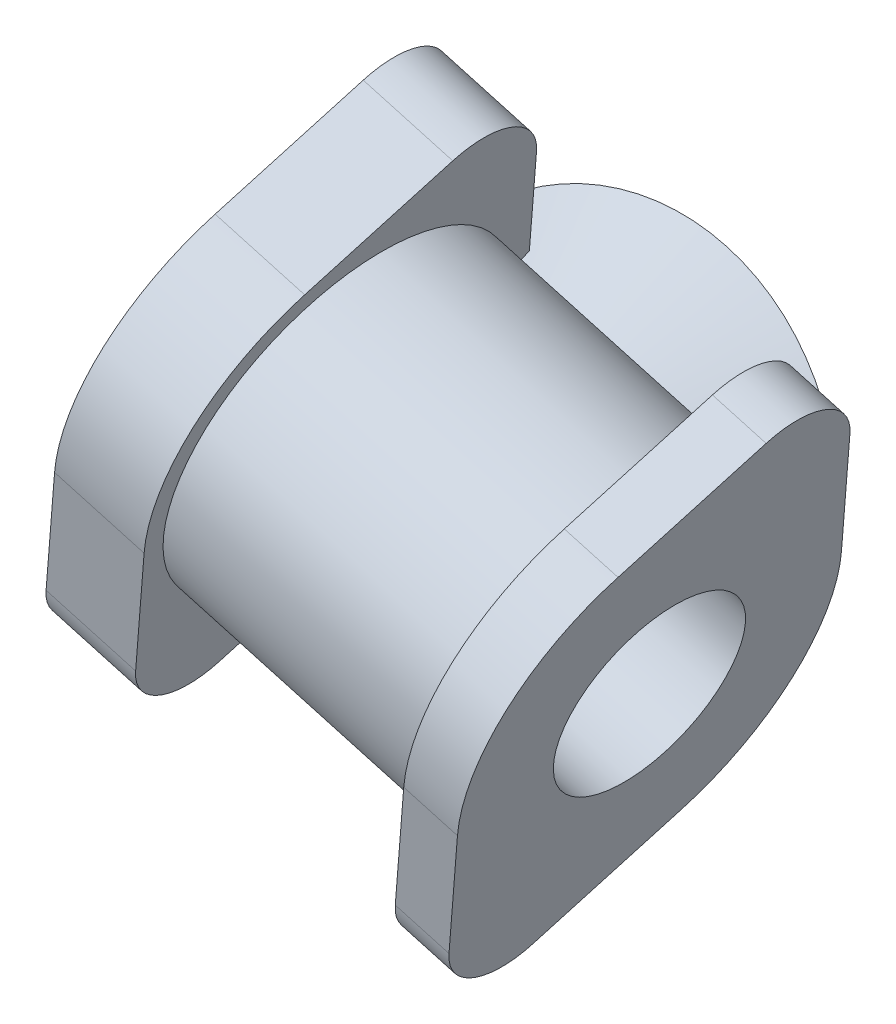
ISO-10303-21;
HEADER;
FILE_DESCRIPTION(('STEP AP214'),'2;1');
FILE_NAME('part.step','',(''),(''),'','','');
FILE_SCHEMA(('AUTOMOTIVE_DESIGN { 1 0 10303 214 1 1 1 1 }'));
ENDSEC;
DATA;
#1=APPLICATION_CONTEXT('core data for automotive mechanical design processes');
#2=APPLICATION_PROTOCOL_DEFINITION('international standard','automotive_design',2000,#1);
#3=PRODUCT_CONTEXT('',#1,'mechanical');
#4=PRODUCT('Part','Part','',(#3));
#5=PRODUCT_RELATED_PRODUCT_CATEGORY('part','',(#4));
#6=PRODUCT_DEFINITION_FORMATION('','',#4);
#7=PRODUCT_DEFINITION_CONTEXT('part definition',#1,'design');
#8=PRODUCT_DEFINITION('design','',#6,#7);
#9=PRODUCT_DEFINITION_SHAPE('','',#8);
#10=(LENGTH_UNIT() NAMED_UNIT(*) SI_UNIT(.MILLI.,.METRE.));
#11=(NAMED_UNIT(*) PLANE_ANGLE_UNIT() SI_UNIT($,.RADIAN.));
#12=(NAMED_UNIT(*) SI_UNIT($,.STERADIAN.) SOLID_ANGLE_UNIT());
#13=UNCERTAINTY_MEASURE_WITH_UNIT(LENGTH_MEASURE(1.E-05),#10,'distance_accuracy_value','');
#14=(GEOMETRIC_REPRESENTATION_CONTEXT(3) GLOBAL_UNCERTAINTY_ASSIGNED_CONTEXT((#13)) GLOBAL_UNIT_ASSIGNED_CONTEXT((#10,
#11,#12)) REPRESENTATION_CONTEXT('',''));
#15=CARTESIAN_POINT('',(0.,0.,0.));
#16=DIRECTION('',(0.,0.,1.));
#17=DIRECTION('',(1.,0.,0.));
#18=AXIS2_PLACEMENT_3D('',#15,#16,#17);
#19=CARTESIAN_POINT('',(-884.568440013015,-292.24881423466,-445.430034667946));
#20=DIRECTION('',(0.962250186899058,-0.272162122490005,-0.00153521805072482));
#21=DIRECTION('',(0.272162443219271,0.962251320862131,0.));
#22=AXIS2_PLACEMENT_3D('',#19,#20,#21);
#23=CYLINDRICAL_SURFACE('',#22,12.7);
#24=CARTESIAN_POINT('',(-884.568440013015,-292.24881423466,-445.430034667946));
#25=DIRECTION('',(0.962250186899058,-0.272162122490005,-0.00153521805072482));
#26=DIRECTION('',(0.272162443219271,0.962251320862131,0.));
#27=AXIS2_PLACEMENT_3D('',#24,#25,#26);
#28=CIRCLE('',#27,12.7);
#29=CARTESIAN_POINT('',(-881.11197698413,-280.028222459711,-445.430034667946));
#30=VERTEX_POINT('',#29);
#31=EDGE_CURVE('E211',#30,#30,#28,.F.);
#32=ORIENTED_EDGE('',*,*,#31,.T.);
#33=EDGE_LOOP('',(#32));
#34=FACE_BOUND('',#33,.T.);
#35=CARTESIAN_POINT('',(-829.575841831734,-307.802879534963,-445.517772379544));
#36=DIRECTION('',(0.962250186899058,-0.272162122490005,-0.00153521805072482));
#37=DIRECTION('',(0.272162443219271,0.962251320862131,0.));
#38=AXIS2_PLACEMENT_3D('',#35,#36,#37);
#39=CIRCLE('',#38,12.7);
#40=CARTESIAN_POINT('',(-826.119378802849,-295.582287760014,-445.517772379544));
#41=VERTEX_POINT('',#40);
#42=EDGE_CURVE('E20',#41,#41,#39,.T.);
#43=ORIENTED_EDGE('',*,*,#42,.T.);
#44=EDGE_LOOP('',(#43));
#45=FACE_BOUND('',#44,.T.);
#46=ADVANCED_FACE('F17',(#34,#45),#23,.F.);
#47=CARTESIAN_POINT('',(-836.908188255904,-305.72900416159,-445.506074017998));
#48=DIRECTION('',(0.962250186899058,-0.272162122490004,-0.00153521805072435));
#49=DIRECTION('',(0.272162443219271,0.962251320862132,0.));
#50=AXIS2_PLACEMENT_3D('',#47,#48,#49);
#51=PLANE('',#50);
#52=CARTESIAN_POINT('',(-836.908188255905,-305.72900416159,-445.506074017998));
#53=DIRECTION('',(0.962250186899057,-0.272162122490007,-0.00153521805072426));
#54=DIRECTION('',(0.272162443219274,0.962251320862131,0.));
#55=AXIS2_PLACEMENT_3D('',#52,#53,#54);
#56=CIRCLE('',#55,25.4);
#57=CARTESIAN_POINT('',(-840.825380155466,-319.460044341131,-466.5126002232));
#58=VERTEX_POINT('',#57);
#59=CARTESIAN_POINT('',(-837.885848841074,-309.043654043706,-470.669882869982));
#60=VERTEX_POINT('',#59);
#61=EDGE_CURVE('E370',#58,#60,#56,.T.);
#62=ORIENTED_EDGE('',*,*,#61,.F.);
#63=DIRECTION('',(-0.253535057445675,-0.89841536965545,0.358566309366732));
#64=VECTOR('',#63,1.);
#65=CARTESIAN_POINT('',(-837.885848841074,-309.043654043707,-470.669882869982));
#66=LINE('',#65,#64);
#67=EDGE_CURVE('E176',#60,#58,#66,.T.);
#68=ORIENTED_EDGE('',*,*,#67,.F.);
#69=EDGE_LOOP('',(#62,#68));
#70=FACE_BOUND('',#69,.T.);
#71=ADVANCED_FACE('F399',(#70),#51,.F.);
#72=CARTESIAN_POINT('',(-819.277020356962,-271.294928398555,-462.478607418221));
#73=DIRECTION('',(-0.962250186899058,0.272162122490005,0.00153521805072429));
#74=DIRECTION('',(-0.272162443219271,-0.962251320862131,0.));
#75=AXIS2_PLACEMENT_3D('',#72,#73,#74);
#76=PLANE('',#75);
#77=CARTESIAN_POINT('',(-829.575841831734,-307.802879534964,-445.517772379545));
#78=DIRECTION('',(0.962250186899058,-0.272162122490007,-0.00153521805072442));
#79=DIRECTION('',(0.272162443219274,0.962251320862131,0.));
#80=AXIS2_PLACEMENT_3D('',#77,#78,#79);
#81=CIRCLE('',#80,25.4);
#82=CARTESIAN_POINT('',(-830.977754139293,-312.899588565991,-420.673895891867));
#83=VERTEX_POINT('',#82);
#84=CARTESIAN_POINT('',(-823.277071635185,-285.592841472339,-434.925336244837));
#85=VERTEX_POINT('',#84);
#86=EDGE_CURVE('E382',#83,#85,#81,.F.);
#87=ORIENTED_EDGE('',*,*,#86,.F.);
#88=DIRECTION('',(0.26651128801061,0.941097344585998,0.208104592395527));
#89=VECTOR('',#88,1.);
#90=CARTESIAN_POINT('',(-836.262104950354,-331.559543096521,-424.800166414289));
#91=LINE('',#90,#89);
#92=CARTESIAN_POINT('',(-836.262104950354,-331.55954309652,-424.800166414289));
#93=VERTEX_POINT('',#92);
#94=EDGE_CURVE('E218',#93,#83,#91,.T.);
#95=ORIENTED_EDGE('',*,*,#94,.F.);
#96=CARTESIAN_POINT('',(-835.73638783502,-329.648277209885,-434.116620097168));
#97=DIRECTION('',(0.962250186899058,-0.272162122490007,-0.00153521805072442));
#98=DIRECTION('',(0.272162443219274,0.962251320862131,0.));
#99=AXIS2_PLACEMENT_3D('',#96,#97,#98);
#100=CIRCLE('',#99,9.52500000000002);
#101=CARTESIAN_POINT('',(-838.098426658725,-337.977041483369,-438.088783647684));
#102=VERTEX_POINT('',#101);
#103=EDGE_CURVE('E379',#102,#93,#100,.F.);
#104=ORIENTED_EDGE('',*,*,#103,.F.);
#105=DIRECTION('',(-0.112156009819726,-0.401663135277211,0.90889369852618));
#106=VECTOR('',#105,1.);
#107=CARTESIAN_POINT('',(-835.874612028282,-330.012917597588,-456.110208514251));
#108=LINE('',#107,#106);
#109=CARTESIAN_POINT('',(-835.874612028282,-330.012917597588,-456.110208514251));
#110=VERTEX_POINT('',#109);
#111=EDGE_CURVE('E212',#110,#102,#108,.T.);
#112=ORIENTED_EDGE('',*,*,#111,.F.);
#113=CARTESIAN_POINT('',(-829.575841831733,-307.802879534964,-445.517772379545));
#114=DIRECTION('',(0.962250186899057,-0.272162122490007,-0.00153521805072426));
#115=DIRECTION('',(0.272162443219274,0.962251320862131,0.));
#116=AXIS2_PLACEMENT_3D('',#113,#114,#115);
#117=CIRCLE('',#116,25.4);
#118=CARTESIAN_POINT('',(-828.173929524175,-302.706170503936,-470.361648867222));
#119=VERTEX_POINT('',#118);
#120=EDGE_CURVE('E173',#119,#110,#117,.F.);
#121=ORIENTED_EDGE('',*,*,#120,.F.);
#122=DIRECTION('',(-0.266511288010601,-0.941097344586,-0.208104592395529));
#123=VECTOR('',#122,1.);
#124=CARTESIAN_POINT('',(-822.889578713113,-284.046215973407,-466.2353783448));
#125=LINE('',#124,#123);
#126=CARTESIAN_POINT('',(-822.889578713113,-284.046215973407,-466.235378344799));
#127=VERTEX_POINT('',#126);
#128=EDGE_CURVE('E169',#127,#119,#125,.T.);
#129=ORIENTED_EDGE('',*,*,#128,.F.);
#130=CARTESIAN_POINT('',(-823.415295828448,-285.957481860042,-456.918924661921));
#131=DIRECTION('',(0.962250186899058,-0.272162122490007,-0.00153521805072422));
#132=DIRECTION('',(0.272162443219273,0.962251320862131,0.));
#133=AXIS2_PLACEMENT_3D('',#130,#131,#132);
#134=CIRCLE('',#133,9.52500000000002);
#135=CARTESIAN_POINT('',(-821.053257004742,-277.628717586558,-452.946761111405));
#136=VERTEX_POINT('',#135);
#137=EDGE_CURVE('E156',#136,#127,#134,.F.);
#138=ORIENTED_EDGE('',*,*,#137,.F.);
#139=DIRECTION('',(0.112156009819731,0.40166313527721,-0.90889369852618));
#140=VECTOR('',#139,1.);
#141=CARTESIAN_POINT('',(-823.277071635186,-285.592841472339,-434.925336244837));
#142=LINE('',#141,#140);
#143=EDGE_CURVE('E166',#85,#136,#142,.T.);
#144=ORIENTED_EDGE('',*,*,#143,.F.);
#145=EDGE_LOOP('',(#87,#95,#104,#112,#121,#129,#138,#144));
#146=FACE_BOUND('',#145,.T.);
#147=ORIENTED_EDGE('',*,*,#42,.F.);
#148=EDGE_LOOP('',(#147));
#149=FACE_BOUND('',#148,.T.);
#150=ADVANCED_FACE('F170',(#146,#149),#76,.F.);
#151=CARTESIAN_POINT('',(-862.049041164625,-259.197322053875,-462.410366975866));
#152=DIRECTION('',(-0.962250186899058,0.272162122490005,0.00153521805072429));
#153=DIRECTION('',(-0.272162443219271,-0.962251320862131,0.));
#154=AXIS2_PLACEMENT_3D('',#151,#152,#153);
#155=PLANE('',#154);
#156=CARTESIAN_POINT('',(-872.347862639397,-295.705273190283,-445.44953193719));
#157=DIRECTION('',(0.962250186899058,-0.272162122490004,-0.0015352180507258));
#158=DIRECTION('',(0.272162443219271,0.962251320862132,0.));
#159=AXIS2_PLACEMENT_3D('',#156,#157,#158);
#160=CIRCLE('',#159,25.4);
#161=CARTESIAN_POINT('',(-873.325523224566,-299.019923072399,-470.613340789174));
#162=VERTEX_POINT('',#161);
#163=CARTESIAN_POINT('',(-876.265054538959,-309.436313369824,-466.456058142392));
#164=VERTEX_POINT('',#163);
#165=EDGE_CURVE('E364',#162,#164,#160,.F.);
#166=ORIENTED_EDGE('',*,*,#165,.F.);
#167=DIRECTION('',(0.253535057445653,0.898415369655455,-0.358566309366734));
#168=VECTOR('',#167,1.);
#169=CARTESIAN_POINT('',(-876.265054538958,-309.436313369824,-466.456058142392));
#170=LINE('',#169,#168);
#171=EDGE_CURVE('E209',#164,#162,#170,.T.);
#172=ORIENTED_EDGE('',*,*,#171,.F.);
#173=EDGE_LOOP('',(#166,#172));
#174=FACE_BOUND('',#173,.T.);
#175=ADVANCED_FACE('F398',(#174),#155,.F.);
#176=CARTESIAN_POINT('',(-884.568440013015,-292.24881423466,-445.430034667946));
#177=DIRECTION('',(0.962250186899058,-0.272162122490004,-0.00153521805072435));
#178=DIRECTION('',(0.272162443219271,0.962251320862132,0.));
#179=AXIS2_PLACEMENT_3D('',#176,#177,#178);
#180=PLANE('',#179);
#181=ORIENTED_EDGE('',*,*,#31,.F.);
#182=EDGE_LOOP('',(#181));
#183=FACE_BOUND('',#182,.T.);
#184=DIRECTION('',(-0.112156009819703,-0.401663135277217,0.90889369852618));
#185=VECTOR('',#184,1.);
#186=CARTESIAN_POINT('',(-876.045855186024,-262.074652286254,-452.859023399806));
#187=LINE('',#186,#185);
#188=CARTESIAN_POINT('',(-876.045855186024,-262.074652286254,-452.859023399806));
#189=VERTEX_POINT('',#188);
#190=CARTESIAN_POINT('',(-878.269669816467,-270.038776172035,-434.837598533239));
#191=VERTEX_POINT('',#190);
#192=EDGE_CURVE('E194',#189,#191,#187,.T.);
#193=ORIENTED_EDGE('',*,*,#192,.F.);
#194=CARTESIAN_POINT('',(-878.407894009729,-270.403416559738,-456.831186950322));
#195=DIRECTION('',(0.962250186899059,-0.272162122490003,-0.00153521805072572));
#196=DIRECTION('',(0.272162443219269,0.962251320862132,0.));
#197=AXIS2_PLACEMENT_3D('',#194,#195,#196);
#198=CIRCLE('',#197,9.52500000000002);
#199=CARTESIAN_POINT('',(-877.882176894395,-268.492150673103,-466.147640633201));
#200=VERTEX_POINT('',#199);
#201=EDGE_CURVE('E346',#200,#189,#198,.T.);
#202=ORIENTED_EDGE('',*,*,#201,.F.);
#203=DIRECTION('',(0.266511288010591,0.941097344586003,0.20810459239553));
#204=VECTOR('',#203,1.);
#205=CARTESIAN_POINT('',(-883.166527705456,-287.152105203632,-470.273911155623));
#206=LINE('',#205,#204);
#207=CARTESIAN_POINT('',(-883.166527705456,-287.152105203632,-470.273911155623));
#208=VERTEX_POINT('',#207);
#209=EDGE_CURVE('E189',#208,#200,#206,.T.);
#210=ORIENTED_EDGE('',*,*,#209,.F.);
#211=CARTESIAN_POINT('',(-884.568440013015,-292.24881423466,-445.430034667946));
#212=DIRECTION('',(0.962250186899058,-0.272162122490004,-0.0015352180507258));
#213=DIRECTION('',(0.272162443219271,0.962251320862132,0.));
#214=AXIS2_PLACEMENT_3D('',#211,#212,#213);
#215=CIRCLE('',#214,25.4);
#216=CARTESIAN_POINT('',(-890.867210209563,-314.458852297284,-456.022470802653));
#217=VERTEX_POINT('',#216);
#218=EDGE_CURVE('E208',#217,#208,#215,.T.);
#219=ORIENTED_EDGE('',*,*,#218,.F.);
#220=DIRECTION('',(0.112156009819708,0.401663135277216,-0.90889369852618));
#221=VECTOR('',#220,1.);
#222=CARTESIAN_POINT('',(-893.091024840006,-322.422976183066,-438.001045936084));
#223=LINE('',#222,#221);
#224=CARTESIAN_POINT('',(-893.091024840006,-322.422976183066,-438.001045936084));
#225=VERTEX_POINT('',#224);
#226=EDGE_CURVE('E204',#225,#217,#223,.T.);
#227=ORIENTED_EDGE('',*,*,#226,.F.);
#228=CARTESIAN_POINT('',(-890.7289860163,-314.094211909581,-434.028882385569));
#229=DIRECTION('',(0.962250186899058,-0.272162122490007,-0.00153521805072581));
#230=DIRECTION('',(0.272162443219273,0.962251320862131,0.));
#231=AXIS2_PLACEMENT_3D('',#228,#229,#230);
#232=CIRCLE('',#231,9.52500000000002);
#233=CARTESIAN_POINT('',(-891.254703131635,-316.005477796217,-424.71242870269));
#234=VERTEX_POINT('',#233);
#235=EDGE_CURVE('E359',#234,#225,#232,.T.);
#236=ORIENTED_EDGE('',*,*,#235,.F.);
#237=DIRECTION('',(-0.266511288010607,-0.941097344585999,-0.208104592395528));
#238=VECTOR('',#237,1.);
#239=CARTESIAN_POINT('',(-885.970352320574,-297.345523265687,-420.586158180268));
#240=LINE('',#239,#238);
#241=CARTESIAN_POINT('',(-885.970352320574,-297.345523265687,-420.586158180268));
#242=VERTEX_POINT('',#241);
#243=EDGE_CURVE('E199',#242,#234,#240,.T.);
#244=ORIENTED_EDGE('',*,*,#243,.F.);
#245=CARTESIAN_POINT('',(-884.568440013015,-292.24881423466,-445.430034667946));
#246=DIRECTION('',(0.962250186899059,-0.272162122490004,-0.00153521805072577));
#247=DIRECTION('',(0.27216244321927,0.962251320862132,0.));
#248=AXIS2_PLACEMENT_3D('',#245,#246,#247);
#249=CIRCLE('',#248,25.4);
#250=EDGE_CURVE('E354',#191,#242,#249,.T.);
#251=ORIENTED_EDGE('',*,*,#250,.F.);
#252=EDGE_LOOP('',(#193,#202,#210,#219,#227,#236,#244,#251));
#253=FACE_BOUND('',#252,.T.);
#254=ADVANCED_FACE('F405',(#183,#253),#180,.F.);
#255=CARTESIAN_POINT('',(-859.519567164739,-308.548691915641,-468.559071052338));
#256=DIRECTION('',(-0.0989674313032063,-0.344641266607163,-0.933502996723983));
#257=DIRECTION('',(0.,0.938108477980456,-0.346341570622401));
#258=AXIS2_PLACEMENT_3D('',#255,#256,#257);
#259=PLANE('',#258);
#260=ORIENTED_EDGE('',*,*,#67,.T.);
#261=DIRECTION('',(0.962250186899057,-0.272162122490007,-0.00153521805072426));
#262=VECTOR('',#261,1.);
#263=CARTESIAN_POINT('',(-840.825380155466,-319.46004434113,-466.5126002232));
#264=LINE('',#263,#262);
#265=CARTESIAN_POINT('',(-834.064816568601,-321.372197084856,-466.523386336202));
#266=VERTEX_POINT('',#265);
#267=EDGE_CURVE('E371',#266,#58,#264,.F.);
#268=ORIENTED_EDGE('',*,*,#267,.F.);
#269=CARTESIAN_POINT('',(-859.519567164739,-308.548691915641,-468.559071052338));
#270=DIRECTION('',(-0.098967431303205,-0.344641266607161,-0.933502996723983));
#271=DIRECTION('',(0.,0.938108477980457,-0.3463415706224));
#272=AXIS2_PLACEMENT_3D('',#269,#270,#271);
#273=CIRCLE('',#272,28.5750000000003);
#274=CARTESIAN_POINT('',(-887.91384907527,-306.141577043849,-466.437473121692));
#275=VERTEX_POINT('',#274);
#276=EDGE_CURVE('E451',#275,#266,#273,.F.);
#277=ORIENTED_EDGE('',*,*,#276,.F.);
#278=DIRECTION('',(0.962250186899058,-0.272162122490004,-0.0015352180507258));
#279=VECTOR('',#278,1.);
#280=CARTESIAN_POINT('',(-888.485631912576,-305.979854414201,-466.436560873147));
#281=LINE('',#280,#279);
#282=EDGE_CURVE('E362',#164,#275,#281,.F.);
#283=ORIENTED_EDGE('',*,*,#282,.F.);
#284=ORIENTED_EDGE('',*,*,#171,.T.);
#285=DIRECTION('',(0.962250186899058,-0.272162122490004,-0.0015352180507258));
#286=VECTOR('',#285,1.);
#287=CARTESIAN_POINT('',(-885.546100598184,-295.563464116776,-470.59384351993));
#288=LINE('',#287,#286);
#289=CARTESIAN_POINT('',(-884.974317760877,-295.725186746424,-470.594755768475));
#290=VERTEX_POINT('',#289);
#291=EDGE_CURVE('E365',#290,#162,#288,.T.);
#292=ORIENTED_EDGE('',*,*,#291,.F.);
#293=CARTESIAN_POINT('',(-859.519567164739,-308.548691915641,-468.559071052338));
#294=DIRECTION('',(-0.0989674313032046,-0.344641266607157,-0.933502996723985));
#295=DIRECTION('',(0.,0.938108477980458,-0.346341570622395));
#296=AXIS2_PLACEMENT_3D('',#293,#294,#295);
#297=CIRCLE('',#296,28.5750000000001);
#298=CARTESIAN_POINT('',(-831.125285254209,-310.955806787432,-470.680668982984));
#299=VERTEX_POINT('',#298);
#300=EDGE_CURVE('E192',#299,#290,#297,.F.);
#301=ORIENTED_EDGE('',*,*,#300,.F.);
#302=DIRECTION('',(0.962250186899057,-0.272162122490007,-0.00153521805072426));
#303=VECTOR('',#302,1.);
#304=CARTESIAN_POINT('',(-837.885848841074,-309.043654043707,-470.669882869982));
#305=LINE('',#304,#303);
#306=EDGE_CURVE('E188',#60,#299,#305,.T.);
#307=ORIENTED_EDGE('',*,*,#306,.F.);
#308=EDGE_LOOP('',(#260,#268,#277,#283,#284,#292,#301,#307));
#309=FACE_BOUND('',#308,.T.);
#310=ADVANCED_FACE('F412',(#309),#259,.T.);
#311=CARTESIAN_POINT('',(-830.221925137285,-281.972340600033,-466.223679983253));
#312=DIRECTION('',(0.0551933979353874,0.200657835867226,-0.978105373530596));
#313=DIRECTION('',(0.,0.979598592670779,0.200964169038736));
#314=AXIS2_PLACEMENT_3D('',#311,#312,#313);
#315=PLANE('',#314);
#316=ORIENTED_EDGE('',*,*,#128,.T.);
#317=DIRECTION('',(0.962250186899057,-0.272162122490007,-0.00153521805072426));
#318=VECTOR('',#317,1.);
#319=CARTESIAN_POINT('',(-835.506275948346,-300.632295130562,-470.349950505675));
#320=LINE('',#319,#318);
#321=CARTESIAN_POINT('',(-835.506275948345,-300.632295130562,-470.349950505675));
#322=VERTEX_POINT('',#321);
#323=EDGE_CURVE('E186',#322,#119,#320,.T.);
#324=ORIENTED_EDGE('',*,*,#323,.F.);
#325=DIRECTION('',(0.266511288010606,0.941097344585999,0.208104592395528));
#326=VECTOR('',#325,1.);
#327=CARTESIAN_POINT('',(-835.506275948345,-300.632295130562,-470.349950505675));
#328=LINE('',#327,#326);
#329=CARTESIAN_POINT('',(-830.221925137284,-281.972340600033,-466.223679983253));
#330=VERTEX_POINT('',#329);
#331=EDGE_CURVE('E181',#322,#330,#328,.T.);
#332=ORIENTED_EDGE('',*,*,#331,.T.);
#333=DIRECTION('',(0.962250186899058,-0.272162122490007,-0.00153521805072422));
#334=VECTOR('',#333,1.);
#335=CARTESIAN_POINT('',(-830.221925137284,-281.972340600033,-466.223679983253));
#336=LINE('',#335,#334);
#337=EDGE_CURVE('E162',#127,#330,#336,.F.);
#338=ORIENTED_EDGE('',*,*,#337,.F.);
#339=EDGE_LOOP('',(#316,#324,#332,#338));
#340=FACE_BOUND('',#339,.T.);
#341=ADVANCED_FACE('F179',(#340),#315,.T.);
#342=CARTESIAN_POINT('',(-830.747642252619,-283.883606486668,-456.907226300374));
#343=DIRECTION('',(0.962250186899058,-0.272162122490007,-0.00153521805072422));
#344=DIRECTION('',(0.272162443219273,0.962251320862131,0.));
#345=AXIS2_PLACEMENT_3D('',#342,#343,#344);
#346=CYLINDRICAL_SURFACE('',#345,9.52500000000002);
#347=DIRECTION('',(-0.962250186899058,0.272162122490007,0.00153521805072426));
#348=VECTOR('',#347,1.);
#349=CARTESIAN_POINT('',(-821.053257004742,-277.628717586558,-452.946761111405));
#350=LINE('',#349,#348);
#351=CARTESIAN_POINT('',(-828.385603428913,-275.554842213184,-452.935062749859));
#352=VERTEX_POINT('',#351);
#353=EDGE_CURVE('E164',#136,#352,#350,.T.);
#354=ORIENTED_EDGE('',*,*,#353,.F.);
#355=ORIENTED_EDGE('',*,*,#137,.T.);
#356=ORIENTED_EDGE('',*,*,#337,.T.);
#357=CARTESIAN_POINT('',(-830.747642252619,-283.883606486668,-456.907226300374));
#358=DIRECTION('',(0.962250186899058,-0.272162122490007,-0.00153521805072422));
#359=DIRECTION('',(0.272162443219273,0.962251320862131,0.));
#360=AXIS2_PLACEMENT_3D('',#357,#358,#359);
#361=CIRCLE('',#360,9.52500000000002);
#362=EDGE_CURVE('E339',#330,#352,#361,.T.);
#363=ORIENTED_EDGE('',*,*,#362,.T.);
#364=EDGE_LOOP('',(#354,#355,#356,#363));
#365=FACE_BOUND('',#364,.T.);
#366=ADVANCED_FACE('F160',(#365),#346,.T.);
#367=CARTESIAN_POINT('',(-830.609418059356,-283.518966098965,-434.913637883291));
#368=DIRECTION('',(0.247983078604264,0.874410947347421,0.417025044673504));
#369=DIRECTION('',(0.,-0.430471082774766,0.902604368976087));
#370=AXIS2_PLACEMENT_3D('',#367,#368,#369);
#371=PLANE('',#370);
#372=ORIENTED_EDGE('',*,*,#143,.T.);
#373=ORIENTED_EDGE('',*,*,#353,.T.);
#374=DIRECTION('',(-0.112156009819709,-0.401663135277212,0.908893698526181));
#375=VECTOR('',#374,1.);
#376=CARTESIAN_POINT('',(-828.385603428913,-275.554842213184,-452.935062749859));
#377=LINE('',#376,#375);
#378=CARTESIAN_POINT('',(-830.609418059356,-283.518966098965,-434.913637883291));
#379=VERTEX_POINT('',#378);
#380=EDGE_CURVE('E337',#352,#379,#377,.T.);
#381=ORIENTED_EDGE('',*,*,#380,.T.);
#382=DIRECTION('',(0.962250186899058,-0.272162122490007,-0.00153521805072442));
#383=VECTOR('',#382,1.);
#384=CARTESIAN_POINT('',(-830.609418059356,-283.518966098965,-434.913637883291));
#385=LINE('',#384,#383);
#386=EDGE_CURVE('E222',#85,#379,#385,.F.);
#387=ORIENTED_EDGE('',*,*,#386,.F.);
#388=EDGE_LOOP('',(#372,#373,#381,#387));
#389=FACE_BOUND('',#388,.T.);
#390=ADVANCED_FACE('F421',(#389),#371,.T.);
#391=CARTESIAN_POINT('',(-836.908188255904,-305.72900416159,-445.506074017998));
#392=DIRECTION('',(0.962250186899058,-0.272162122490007,-0.00153521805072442));
#393=DIRECTION('',(0.272162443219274,0.962251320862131,0.));
#394=AXIS2_PLACEMENT_3D('',#391,#392,#393);
#395=CYLINDRICAL_SURFACE('',#394,25.4);
#396=ORIENTED_EDGE('',*,*,#386,.T.);
#397=CARTESIAN_POINT('',(-836.908188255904,-305.72900416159,-445.506074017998));
#398=DIRECTION('',(0.962250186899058,-0.272162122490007,-0.00153521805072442));
#399=DIRECTION('',(0.272162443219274,0.962251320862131,0.));
#400=AXIS2_PLACEMENT_3D('',#397,#398,#399);
#401=CIRCLE('',#400,25.4);
#402=CARTESIAN_POINT('',(-838.310100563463,-310.825713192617,-420.662197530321));
#403=VERTEX_POINT('',#402);
#404=EDGE_CURVE('E336',#379,#403,#401,.T.);
#405=ORIENTED_EDGE('',*,*,#404,.T.);
#406=DIRECTION('',(-0.962250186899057,0.27216212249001,0.00153521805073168));
#407=VECTOR('',#406,1.);
#408=CARTESIAN_POINT('',(-830.977754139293,-312.899588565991,-420.673895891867));
#409=LINE('',#408,#407);
#410=EDGE_CURVE('E221',#83,#403,#409,.T.);
#411=ORIENTED_EDGE('',*,*,#410,.F.);
#412=ORIENTED_EDGE('',*,*,#86,.T.);
#413=EDGE_LOOP('',(#396,#405,#411,#412));
#414=FACE_BOUND('',#413,.T.);
#415=ADVANCED_FACE('F424',(#414),#395,.T.);
#416=CARTESIAN_POINT('',(-843.594451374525,-329.485667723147,-424.788468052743));
#417=DIRECTION('',(-0.0551933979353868,-0.200657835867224,0.978105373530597));
#418=DIRECTION('',(0.,-0.979598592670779,-0.200964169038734));
#419=AXIS2_PLACEMENT_3D('',#416,#417,#418);
#420=PLANE('',#419);
#421=ORIENTED_EDGE('',*,*,#94,.T.);
#422=ORIENTED_EDGE('',*,*,#410,.T.);
#423=DIRECTION('',(-0.266511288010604,-0.941097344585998,-0.208104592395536));
#424=VECTOR('',#423,1.);
#425=CARTESIAN_POINT('',(-838.310100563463,-310.825713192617,-420.662197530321));
#426=LINE('',#425,#424);
#427=CARTESIAN_POINT('',(-843.594451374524,-329.485667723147,-424.788468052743));
#428=VERTEX_POINT('',#427);
#429=EDGE_CURVE('E330',#403,#428,#426,.T.);
#430=ORIENTED_EDGE('',*,*,#429,.T.);
#431=DIRECTION('',(0.962250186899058,-0.272162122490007,-0.00153521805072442));
#432=VECTOR('',#431,1.);
#433=CARTESIAN_POINT('',(-843.594451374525,-329.485667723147,-424.788468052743));
#434=LINE('',#433,#432);
#435=EDGE_CURVE('E215',#93,#428,#434,.F.);
#436=ORIENTED_EDGE('',*,*,#435,.F.);
#437=EDGE_LOOP('',(#421,#422,#430,#436));
#438=FACE_BOUND('',#437,.T.);
#439=ADVANCED_FACE('F428',(#438),#420,.T.);
#440=CARTESIAN_POINT('',(-843.06873425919,-327.574401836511,-434.104921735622));
#441=DIRECTION('',(0.962250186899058,-0.272162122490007,-0.00153521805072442));
#442=DIRECTION('',(0.272162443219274,0.962251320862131,0.));
#443=AXIS2_PLACEMENT_3D('',#440,#441,#442);
#444=CYLINDRICAL_SURFACE('',#443,9.52500000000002);
#445=ORIENTED_EDGE('',*,*,#435,.T.);
#446=CARTESIAN_POINT('',(-843.06873425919,-327.574401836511,-434.104921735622));
#447=DIRECTION('',(0.962250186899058,-0.272162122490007,-0.00153521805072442));
#448=DIRECTION('',(0.272162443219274,0.962251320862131,0.));
#449=AXIS2_PLACEMENT_3D('',#446,#447,#448);
#450=CIRCLE('',#449,9.52500000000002);
#451=CARTESIAN_POINT('',(-845.430773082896,-335.903166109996,-438.077085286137));
#452=VERTEX_POINT('',#451);
#453=EDGE_CURVE('E322',#428,#452,#450,.T.);
#454=ORIENTED_EDGE('',*,*,#453,.T.);
#455=DIRECTION('',(-0.96225018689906,0.272162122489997,0.00153521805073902));
#456=VECTOR('',#455,1.);
#457=CARTESIAN_POINT('',(-838.098426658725,-337.977041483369,-438.088783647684));
#458=LINE('',#457,#456);
#459=EDGE_CURVE('E214',#102,#452,#458,.T.);
#460=ORIENTED_EDGE('',*,*,#459,.F.);
#461=ORIENTED_EDGE('',*,*,#103,.T.);
#462=EDGE_LOOP('',(#445,#454,#460,#461));
#463=FACE_BOUND('',#462,.T.);
#464=ADVANCED_FACE('F431',(#463),#444,.T.);
#465=CARTESIAN_POINT('',(-843.206958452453,-327.939042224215,-456.098510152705));
#466=DIRECTION('',(-0.247983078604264,-0.874410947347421,-0.417025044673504));
#467=DIRECTION('',(0.,0.430471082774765,-0.902604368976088));
#468=AXIS2_PLACEMENT_3D('',#465,#466,#467);
#469=PLANE('',#468);
#470=ORIENTED_EDGE('',*,*,#111,.T.);
#471=ORIENTED_EDGE('',*,*,#459,.T.);
#472=DIRECTION('',(0.11215600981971,0.401663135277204,-0.908893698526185));
#473=VECTOR('',#472,1.);
#474=CARTESIAN_POINT('',(-845.430773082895,-335.903166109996,-438.077085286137));
#475=LINE('',#474,#473);
#476=CARTESIAN_POINT('',(-843.206958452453,-327.939042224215,-456.098510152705));
#477=VERTEX_POINT('',#476);
#478=EDGE_CURVE('E320',#452,#477,#475,.T.);
#479=ORIENTED_EDGE('',*,*,#478,.T.);
#480=DIRECTION('',(0.962250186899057,-0.272162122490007,-0.00153521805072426));
#481=VECTOR('',#480,1.);
#482=CARTESIAN_POINT('',(-843.206958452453,-327.939042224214,-456.098510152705));
#483=LINE('',#482,#481);
#484=EDGE_CURVE('E374',#110,#477,#483,.F.);
#485=ORIENTED_EDGE('',*,*,#484,.F.);
#486=EDGE_LOOP('',(#470,#471,#479,#485));
#487=FACE_BOUND('',#486,.T.);
#488=ADVANCED_FACE('F435',(#487),#469,.T.);
#489=CARTESIAN_POINT('',(-836.908188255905,-305.72900416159,-445.506074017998));
#490=DIRECTION('',(0.962250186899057,-0.272162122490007,-0.00153521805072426));
#491=DIRECTION('',(0.272162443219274,0.962251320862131,0.));
#492=AXIS2_PLACEMENT_3D('',#489,#490,#491);
#493=CYLINDRICAL_SURFACE('',#492,25.4);
#494=CARTESIAN_POINT('',(-836.908188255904,-305.72900416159,-445.506074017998));
#495=DIRECTION('',(0.962250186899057,-0.272162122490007,-0.00153521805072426));
#496=DIRECTION('',(0.272162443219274,0.962251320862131,0.));
#497=AXIS2_PLACEMENT_3D('',#494,#495,#496);
#498=CIRCLE('',#497,25.4);
#499=CARTESIAN_POINT('',(-842.465104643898,-325.290058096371,-460.725990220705));
#500=VERTEX_POINT('',#499);
#501=EDGE_CURVE('E257',#477,#500,#498,.T.);
#502=ORIENTED_EDGE('',*,*,#501,.T.);
#503=CARTESIAN_POINT('',(-834.064816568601,-321.372197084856,-466.523386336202));
#504=CARTESIAN_POINT('',(-834.399850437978,-321.706744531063,-466.242218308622));
#505=CARTESIAN_POINT('',(-834.753616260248,-322.016842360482,-465.955754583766));
#506=CARTESIAN_POINT('',(-835.491186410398,-322.590516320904,-465.377244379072));
#507=CARTESIAN_POINT('',(-835.874917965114,-322.854200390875,-465.085212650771));
#508=CARTESIAN_POINT('',(-836.65931037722,-323.334487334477,-464.504630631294));
#509=CARTESIAN_POINT('',(-837.059526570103,-323.551871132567,-464.216115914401));
#510=CARTESIAN_POINT('',(-837.879015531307,-323.949188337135,-463.640007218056));
#511=CARTESIAN_POINT('',(-838.298297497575,-324.129103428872,-463.352413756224));
#512=CARTESIAN_POINT('',(-839.022235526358,-324.405145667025,-462.867690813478));
#513=CARTESIAN_POINT('',(-839.32297386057,-324.510114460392,-462.669647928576));
#514=CARTESIAN_POINT('',(-839.930836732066,-324.704504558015,-462.27596841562));
#515=CARTESIAN_POINT('',(-840.237959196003,-324.793930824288,-462.080331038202));
#516=CARTESIAN_POINT('',(-840.862034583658,-324.959370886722,-461.689408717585));
#517=CARTESIAN_POINT('',(-841.179064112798,-325.035188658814,-461.49416371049));
#518=CARTESIAN_POINT('',(-841.818337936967,-325.1728625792,-461.107250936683));
#519=CARTESIAN_POINT('',(-842.140582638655,-325.23471763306,-460.915583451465));
#520=CARTESIAN_POINT('',(-842.465104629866,-325.290058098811,-460.725990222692));
#521=B_SPLINE_CURVE_WITH_KNOTS('',3,(#503,#504,#505,#506,#507,#508,#509,#510,#511,#512,#513,
#514,#515,#516,#517,#518,#519,#520),.UNSPECIFIED.,.F.,.F.,(4,2,2,2,2,2,2,2,4),(0.,
1.65001096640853,3.29613248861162,4.91179334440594,6.52824209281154,7.6531102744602,
8.77761867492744,9.9172125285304,11.056895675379),.UNSPECIFIED.);
#522=EDGE_CURVE('E446',#266,#500,#521,.T.);
#523=ORIENTED_EDGE('',*,*,#522,.F.);
#524=ORIENTED_EDGE('',*,*,#267,.T.);
#525=ORIENTED_EDGE('',*,*,#61,.T.);
#526=ORIENTED_EDGE('',*,*,#306,.T.);
#527=CARTESIAN_POINT('',(-835.606740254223,-300.987068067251,-470.425549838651));
#528=CARTESIAN_POINT('',(-835.427892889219,-301.230726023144,-470.462571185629));
#529=CARTESIAN_POINT('',(-835.252498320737,-301.477119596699,-470.498142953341));
#530=CARTESIAN_POINT('',(-834.908983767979,-301.975439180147,-470.565945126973));
#531=CARTESIAN_POINT('',(-834.740865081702,-302.227366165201,-470.598174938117));
#532=CARTESIAN_POINT('',(-834.247359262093,-302.992509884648,-470.689300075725));
#533=CARTESIAN_POINT('',(-833.933600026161,-303.514034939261,-470.742466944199));
#534=CARTESIAN_POINT('',(-833.348639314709,-304.565674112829,-470.828432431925));
#535=CARTESIAN_POINT('',(-833.076597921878,-305.095282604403,-470.86168878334));
#536=CARTESIAN_POINT('',(-832.571624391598,-306.173375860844,-470.905532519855));
#537=CARTESIAN_POINT('',(-832.338651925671,-306.721840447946,-470.91614341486));
#538=CARTESIAN_POINT('',(-832.016365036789,-307.575161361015,-470.911479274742));
#539=CARTESIAN_POINT('',(-831.910813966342,-307.874012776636,-470.905988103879));
#540=CARTESIAN_POINT('',(-831.713648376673,-308.47597835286,-470.886512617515));
#541=CARTESIAN_POINT('',(-831.622030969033,-308.77909161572,-470.872530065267));
#542=CARTESIAN_POINT('',(-831.367750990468,-309.701486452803,-470.816223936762));
#543=CARTESIAN_POINT('',(-831.228521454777,-310.326385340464,-470.7595412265));
#544=CARTESIAN_POINT('',(-831.125285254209,-310.955806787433,-470.680668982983));
#545=B_SPLINE_CURVE_WITH_KNOTS('',3,(#527,#528,#529,#530,#531,#532,#533,#534,#535,#536,#537,
#538,#539,#540,#541,#542,#543,#544),.UNSPECIFIED.,.F.,.F.,(4,2,2,2,2,2,2,2,4),(0.,
0.913455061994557,1.8270724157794,3.65826091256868,5.44555039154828,7.23098345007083,
8.18158458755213,9.13198839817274,11.0565462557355),.UNSPECIFIED.);
#546=CARTESIAN_POINT('',(-835.606740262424,-300.987068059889,-470.425549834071));
#547=VERTEX_POINT('',#546);
#548=EDGE_CURVE('E283',#547,#299,#545,.T.);
#549=ORIENTED_EDGE('',*,*,#548,.F.);
#550=CARTESIAN_POINT('',(-836.908188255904,-305.72900416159,-445.506074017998));
#551=DIRECTION('',(0.962250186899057,-0.272162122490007,-0.00153521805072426));
#552=DIRECTION('',(0.272162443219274,0.962251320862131,0.));
#553=AXIS2_PLACEMENT_3D('',#550,#551,#552);
#554=CIRCLE('',#553,25.4);
#555=EDGE_CURVE('E298',#547,#322,#554,.T.);
#556=ORIENTED_EDGE('',*,*,#555,.T.);
#557=ORIENTED_EDGE('',*,*,#323,.T.);
#558=ORIENTED_EDGE('',*,*,#120,.T.);
#559=ORIENTED_EDGE('',*,*,#484,.T.);
#560=EDGE_LOOP('',(#502,#523,#524,#525,#526,#549,#556,#557,#558,#559));
#561=FACE_BOUND('',#560,.T.);
#562=ADVANCED_FACE('F438',(#561),#493,.T.);
#563=CARTESIAN_POINT('',(-884.568440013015,-292.24881423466,-445.430034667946));
#564=DIRECTION('',(0.962250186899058,-0.272162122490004,-0.0015352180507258));
#565=DIRECTION('',(0.272162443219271,0.962251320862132,0.));
#566=AXIS2_PLACEMENT_3D('',#563,#564,#565);
#567=CYLINDRICAL_SURFACE('',#566,25.4);
#568=DIRECTION('',(-0.962250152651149,0.272162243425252,0.00153524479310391));
#569=VECTOR('',#568,1.);
#570=CARTESIAN_POINT('',(-875.369493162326,-289.35741367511,-470.286351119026));
#571=LINE('',#570,#569);
#572=CARTESIAN_POINT('',(-875.369493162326,-289.35741367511,-470.286351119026));
#573=VERTEX_POINT('',#572);
#574=EDGE_CURVE('E193',#573,#208,#571,.T.);
#575=ORIENTED_EDGE('',*,*,#574,.F.);
#576=CARTESIAN_POINT('',(-884.974317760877,-295.725186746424,-470.594755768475));
#577=CARTESIAN_POINT('',(-884.616602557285,-295.311919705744,-470.663078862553));
#578=CARTESIAN_POINT('',(-884.237863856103,-294.915175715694,-470.715186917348));
#579=CARTESIAN_POINT('',(-883.446733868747,-294.155656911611,-470.790853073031));
#580=CARTESIAN_POINT('',(-883.034425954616,-293.792802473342,-470.814479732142));
#581=CARTESIAN_POINT('',(-882.190876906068,-293.106599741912,-470.837136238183));
#582=CARTESIAN_POINT('',(-881.760146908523,-292.782629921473,-470.836626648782));
#583=CARTESIAN_POINT('',(-880.877618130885,-292.165105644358,-470.815728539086));
#584=CARTESIAN_POINT('',(-880.425808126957,-291.871567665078,-470.795329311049));
#585=CARTESIAN_POINT('',(-879.602555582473,-291.372676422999,-470.743965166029));
#586=CARTESIAN_POINT('',(-879.234242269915,-291.161775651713,-470.716132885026));
#587=CARTESIAN_POINT('',(-878.48892458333,-290.757673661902,-470.65158851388));
#588=CARTESIAN_POINT('',(-878.111922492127,-290.564467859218,-470.614878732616));
#589=CARTESIAN_POINT('',(-877.344507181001,-290.192184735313,-470.533298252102));
#590=CARTESIAN_POINT('',(-876.953976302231,-290.013377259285,-470.488308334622));
#591=CARTESIAN_POINT('',(-876.166374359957,-289.672779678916,-470.391859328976));
#592=CARTESIAN_POINT('',(-875.769303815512,-289.510988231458,-470.340400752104));
#593=CARTESIAN_POINT('',(-875.369493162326,-289.35741367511,-470.286351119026));
#594=B_SPLINE_CURVE_WITH_KNOTS('',3,(#576,#577,#578,#579,#580,#581,#582,#583,#584,#585,#586,
#587,#588,#589,#590,#591,#592,#593),.UNSPECIFIED.,.F.,.F.,(4,2,2,2,2,2,2,2,4),(0.,
1.65053184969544,3.29708268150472,4.91222721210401,6.52824174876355,7.8036918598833,
9.07881060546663,10.3739742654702,11.6690356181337),.UNSPECIFIED.);
#595=EDGE_CURVE('E273',#290,#573,#594,.T.);
#596=ORIENTED_EDGE('',*,*,#595,.F.);
#597=ORIENTED_EDGE('',*,*,#291,.T.);
#598=ORIENTED_EDGE('',*,*,#165,.T.);
#599=ORIENTED_EDGE('',*,*,#282,.T.);
#600=CARTESIAN_POINT('',(-878.399693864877,-317.032056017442,-457.847260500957));
#601=CARTESIAN_POINT('',(-878.769227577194,-316.811551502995,-458.04616845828));
#602=CARTESIAN_POINT('',(-879.132914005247,-316.585982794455,-458.250363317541));
#603=CARTESIAN_POINT('',(-879.847707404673,-316.123898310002,-458.668419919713));
#604=CARTESIAN_POINT('',(-880.198811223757,-315.887379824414,-458.882284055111));
#605=CARTESIAN_POINT('',(-880.8888052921,-315.401675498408,-459.319582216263));
#606=CARTESIAN_POINT('',(-881.22763850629,-315.1524409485,-459.543052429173));
#607=CARTESIAN_POINT('',(-881.890217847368,-314.64145292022,-459.997708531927));
#608=CARTESIAN_POINT('',(-882.213965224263,-314.37970048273,-460.228893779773));
#609=CARTESIAN_POINT('',(-883.134507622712,-313.596450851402,-460.913290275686));
#610=CARTESIAN_POINT('',(-883.709556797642,-313.056800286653,-461.375764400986));
#611=CARTESIAN_POINT('',(-884.516074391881,-312.206167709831,-462.08206123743));
#612=CARTESIAN_POINT('',(-884.775429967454,-311.915953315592,-462.319442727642));
#613=CARTESIAN_POINT('',(-885.273463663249,-311.320862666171,-462.797448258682));
#614=CARTESIAN_POINT('',(-885.512146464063,-311.01598975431,-463.038071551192));
#615=CARTESIAN_POINT('',(-885.985056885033,-310.365021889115,-463.54128443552));
#616=CARTESIAN_POINT('',(-886.217288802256,-310.017601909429,-463.80404704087));
#617=CARTESIAN_POINT('',(-886.650519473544,-309.304279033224,-464.329798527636));
#618=CARTESIAN_POINT('',(-886.851537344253,-308.938387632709,-464.592787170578));
#619=CARTESIAN_POINT('',(-887.222073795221,-308.179245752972,-465.12261354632));
#620=CARTESIAN_POINT('',(-887.390791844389,-307.785567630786,-465.389406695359));
#621=CARTESIAN_POINT('',(-887.685783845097,-306.978217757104,-465.918115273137));
#622=CARTESIAN_POINT('',(-887.811963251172,-306.564503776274,-466.180018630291));
#623=CARTESIAN_POINT('',(-887.91384907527,-306.141577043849,-466.437473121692));
#624=B_SPLINE_CURVE_WITH_KNOTS('',3,(#600,#601,#602,#603,#604,#605,#606,#607,#608,#609,#610,
#611,#612,#613,#614,#615,#616,#617,#618,#619,#620,#621,#622,#623),.UNSPECIFIED.,.F.,.F.,(4,2,2,
2,2,2,2,2,2,2,2,4),(0.,1.4221347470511,2.84462332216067,4.27304359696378,5.70134530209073,
8.43893156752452,9.80606045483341,11.1728789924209,12.6525727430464,14.1313566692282,
15.6430492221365,17.1580798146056),.UNSPECIFIED.);
#625=CARTESIAN_POINT('',(-878.399693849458,-317.032056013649,-457.847260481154));
#626=VERTEX_POINT('',#625);
#627=EDGE_CURVE('E454',#626,#275,#624,.T.);
#628=ORIENTED_EDGE('',*,*,#627,.F.);
#629=CARTESIAN_POINT('',(-872.347862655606,-295.705273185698,-445.449531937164));
#630=DIRECTION('',(0.962250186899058,-0.272162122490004,-0.0015352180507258));
#631=DIRECTION('',(0.272162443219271,0.962251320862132,0.));
#632=AXIS2_PLACEMENT_3D('',#629,#630,#631);
#633=CIRCLE('',#632,25.4);
#634=CARTESIAN_POINT('',(-878.64663284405,-317.915311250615,-456.041968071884));
#635=VERTEX_POINT('',#634);
#636=EDGE_CURVE('E485',#626,#635,#633,.F.);
#637=ORIENTED_EDGE('',*,*,#636,.T.);
#638=DIRECTION('',(0.962250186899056,-0.272162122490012,-0.00153521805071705));
#639=VECTOR('',#638,1.);
#640=CARTESIAN_POINT('',(-890.867210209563,-314.458852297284,-456.022470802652));
#641=LINE('',#640,#639);
#642=EDGE_CURVE('E207',#217,#635,#641,.T.);
#643=ORIENTED_EDGE('',*,*,#642,.F.);
#644=ORIENTED_EDGE('',*,*,#218,.T.);
#645=EDGE_LOOP('',(#575,#596,#597,#598,#599,#628,#637,#643,#644));
#646=FACE_BOUND('',#645,.T.);
#647=ADVANCED_FACE('F441',(#646),#567,.T.);
#648=CARTESIAN_POINT('',(-885.978979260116,-315.841435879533,-456.03026971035));
#649=DIRECTION('',(-0.247983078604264,-0.874410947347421,-0.417025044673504));
#650=DIRECTION('',(0.,0.430471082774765,-0.902604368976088));
#651=AXIS2_PLACEMENT_3D('',#648,#649,#650);
#652=PLANE('',#651);
#653=ORIENTED_EDGE('',*,*,#642,.T.);
#654=DIRECTION('',(-0.112156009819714,-0.40166313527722,0.908893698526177));
#655=VECTOR('',#654,1.);
#656=CARTESIAN_POINT('',(-878.646632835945,-317.915311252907,-456.041968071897));
#657=LINE('',#656,#655);
#658=CARTESIAN_POINT('',(-880.870447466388,-325.879435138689,-438.020543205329));
#659=VERTEX_POINT('',#658);
#660=EDGE_CURVE('E333',#635,#659,#657,.T.);
#661=ORIENTED_EDGE('',*,*,#660,.T.);
#662=DIRECTION('',(0.962250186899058,-0.272162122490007,-0.00153521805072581));
#663=VECTOR('',#662,1.);
#664=CARTESIAN_POINT('',(-893.091024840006,-322.422976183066,-438.001045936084));
#665=LINE('',#664,#663);
#666=EDGE_CURVE('E203',#225,#659,#665,.T.);
#667=ORIENTED_EDGE('',*,*,#666,.F.);
#668=ORIENTED_EDGE('',*,*,#226,.T.);
#669=EDGE_LOOP('',(#653,#661,#667,#668));
#670=FACE_BOUND('',#669,.T.);
#671=ADVANCED_FACE('F490',(#670),#652,.T.);
#672=CARTESIAN_POINT('',(-890.7289860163,-314.094211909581,-434.028882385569));
#673=DIRECTION('',(0.962250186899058,-0.272162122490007,-0.00153521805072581));
#674=DIRECTION('',(0.272162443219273,0.962251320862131,0.));
#675=AXIS2_PLACEMENT_3D('',#672,#673,#674);
#676=CYLINDRICAL_SURFACE('',#675,9.52500000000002);
#677=ORIENTED_EDGE('',*,*,#666,.T.);
#678=CARTESIAN_POINT('',(-878.508408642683,-317.550670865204,-434.048379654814));
#679=DIRECTION('',(0.962250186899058,-0.272162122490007,-0.00153521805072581));
#680=DIRECTION('',(0.272162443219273,0.962251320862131,0.));
#681=AXIS2_PLACEMENT_3D('',#678,#679,#680);
#682=CIRCLE('',#681,9.52500000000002);
#683=CARTESIAN_POINT('',(-879.034125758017,-319.46193675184,-424.731925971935));
#684=VERTEX_POINT('',#683);
#685=EDGE_CURVE('E495',#659,#684,#682,.F.);
#686=ORIENTED_EDGE('',*,*,#685,.T.);
#687=DIRECTION('',(0.96225018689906,-0.272162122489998,-0.00153521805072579));
#688=VECTOR('',#687,1.);
#689=CARTESIAN_POINT('',(-891.254703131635,-316.005477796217,-424.71242870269));
#690=LINE('',#689,#688);
#691=EDGE_CURVE('E202',#234,#684,#690,.T.);
#692=ORIENTED_EDGE('',*,*,#691,.F.);
#693=ORIENTED_EDGE('',*,*,#235,.T.);
#694=EDGE_LOOP('',(#677,#686,#692,#693));
#695=FACE_BOUND('',#694,.T.);
#696=ADVANCED_FACE('F538',(#695),#676,.T.);
#697=CARTESIAN_POINT('',(-886.366472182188,-317.388061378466,-424.720227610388));
#698=DIRECTION('',(-0.0551933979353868,-0.200657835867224,0.978105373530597));
#699=DIRECTION('',(0.,-0.979598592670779,-0.200964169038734));
#700=AXIS2_PLACEMENT_3D('',#697,#698,#699);
#701=PLANE('',#700);
#702=ORIENTED_EDGE('',*,*,#691,.T.);
#703=DIRECTION('',(0.266511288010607,0.941097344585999,0.208104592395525));
#704=VECTOR('',#703,1.);
#705=CARTESIAN_POINT('',(-879.034125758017,-319.46193675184,-424.731925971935));
#706=LINE('',#705,#704);
#707=CARTESIAN_POINT('',(-873.749774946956,-300.80198222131,-420.605655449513));
#708=VERTEX_POINT('',#707);
#709=EDGE_CURVE('E496',#684,#708,#706,.T.);
#710=ORIENTED_EDGE('',*,*,#709,.T.);
#711=DIRECTION('',(0.962250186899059,-0.272162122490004,-0.00153521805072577));
#712=VECTOR('',#711,1.);
#713=CARTESIAN_POINT('',(-885.970352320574,-297.345523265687,-420.586158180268));
#714=LINE('',#713,#712);
#715=EDGE_CURVE('E198',#242,#708,#714,.T.);
#716=ORIENTED_EDGE('',*,*,#715,.F.);
#717=ORIENTED_EDGE('',*,*,#243,.T.);
#718=EDGE_LOOP('',(#702,#710,#716,#717));
#719=FACE_BOUND('',#718,.T.);
#720=ADVANCED_FACE('F537',(#719),#701,.T.);
#721=CARTESIAN_POINT('',(-884.568440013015,-292.24881423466,-445.430034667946));
#722=DIRECTION('',(0.962250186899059,-0.272162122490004,-0.00153521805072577));
#723=DIRECTION('',(0.27216244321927,0.962251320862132,0.));
#724=AXIS2_PLACEMENT_3D('',#721,#722,#723);
#725=CYLINDRICAL_SURFACE('',#724,25.4);
#726=ORIENTED_EDGE('',*,*,#715,.T.);
#727=CARTESIAN_POINT('',(-872.347862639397,-295.705273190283,-445.44953193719));
#728=DIRECTION('',(0.962250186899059,-0.272162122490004,-0.00153521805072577));
#729=DIRECTION('',(0.27216244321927,0.962251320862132,0.));
#730=AXIS2_PLACEMENT_3D('',#727,#728,#729);
#731=CIRCLE('',#730,25.4);
#732=CARTESIAN_POINT('',(-866.049092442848,-273.495235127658,-434.857095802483));
#733=VERTEX_POINT('',#732);
#734=EDGE_CURVE('E502',#708,#733,#731,.F.);
#735=ORIENTED_EDGE('',*,*,#734,.T.);
#736=DIRECTION('',(0.96225018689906,-0.27216212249,-0.00153521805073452));
#737=VECTOR('',#736,1.);
#738=CARTESIAN_POINT('',(-878.269669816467,-270.038776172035,-434.837598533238));
#739=LINE('',#738,#737);
#740=EDGE_CURVE('E197',#191,#733,#739,.T.);
#741=ORIENTED_EDGE('',*,*,#740,.F.);
#742=ORIENTED_EDGE('',*,*,#250,.T.);
#743=EDGE_LOOP('',(#726,#735,#741,#742));
#744=FACE_BOUND('',#743,.T.);
#745=ADVANCED_FACE('F530',(#744),#725,.T.);
#746=CARTESIAN_POINT('',(-873.381438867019,-271.421359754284,-434.845397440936));
#747=DIRECTION('',(0.247983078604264,0.874410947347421,0.417025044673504));
#748=DIRECTION('',(0.,-0.430471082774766,0.902604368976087));
#749=AXIS2_PLACEMENT_3D('',#746,#747,#748);
#750=PLANE('',#749);
#751=ORIENTED_EDGE('',*,*,#740,.T.);
#752=DIRECTION('',(0.112156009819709,0.401663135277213,-0.908893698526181));
#753=VECTOR('',#752,1.);
#754=CARTESIAN_POINT('',(-866.049092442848,-273.495235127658,-434.857095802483));
#755=LINE('',#754,#753);
#756=CARTESIAN_POINT('',(-863.825277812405,-265.531111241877,-452.878520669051));
#757=VERTEX_POINT('',#756);
#758=EDGE_CURVE('E505',#733,#757,#755,.T.);
#759=ORIENTED_EDGE('',*,*,#758,.T.);
#760=DIRECTION('',(0.962250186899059,-0.272162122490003,-0.00153521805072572));
#761=VECTOR('',#760,1.);
#762=CARTESIAN_POINT('',(-876.045855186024,-262.074652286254,-452.859023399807));
#763=LINE('',#762,#761);
#764=EDGE_CURVE('E347',#189,#757,#763,.T.);
#765=ORIENTED_EDGE('',*,*,#764,.F.);
#766=ORIENTED_EDGE('',*,*,#192,.T.);
#767=EDGE_LOOP('',(#751,#759,#765,#766));
#768=FACE_BOUND('',#767,.T.);
#769=ADVANCED_FACE('F519',(#768),#750,.T.);
#770=CARTESIAN_POINT('',(-878.407894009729,-270.403416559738,-456.831186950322));
#771=DIRECTION('',(0.962250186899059,-0.272162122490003,-0.00153521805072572));
#772=DIRECTION('',(0.272162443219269,0.962251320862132,0.));
#773=AXIS2_PLACEMENT_3D('',#770,#771,#772);
#774=CYLINDRICAL_SURFACE('',#773,9.52500000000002);
#775=CARTESIAN_POINT('',(-866.187316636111,-273.859875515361,-456.850684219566));
#776=DIRECTION('',(0.962250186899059,-0.272162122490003,-0.00153521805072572));
#777=DIRECTION('',(0.272162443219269,0.962251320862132,0.));
#778=AXIS2_PLACEMENT_3D('',#775,#776,#777);
#779=CIRCLE('',#778,9.52500000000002);
#780=CARTESIAN_POINT('',(-865.661599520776,-271.948609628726,-466.167137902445));
#781=VERTEX_POINT('',#780);
#782=EDGE_CURVE('E506',#757,#781,#779,.F.);
#783=ORIENTED_EDGE('',*,*,#782,.T.);
#784=DIRECTION('',(0.962250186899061,-0.272162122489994,-0.00153521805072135));
#785=VECTOR('',#784,1.);
#786=CARTESIAN_POINT('',(-877.882176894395,-268.492150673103,-466.147640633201));
#787=LINE('',#786,#785);
#788=EDGE_CURVE('E343',#200,#781,#787,.T.);
#789=ORIENTED_EDGE('',*,*,#788,.F.);
#790=ORIENTED_EDGE('',*,*,#201,.T.);
#791=ORIENTED_EDGE('',*,*,#764,.T.);
#792=EDGE_LOOP('',(#783,#789,#790,#791));
#793=FACE_BOUND('',#792,.T.);
#794=ADVANCED_FACE('F524',(#793),#774,.T.);
#795=CARTESIAN_POINT('',(-872.993945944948,-269.874734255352,-466.155439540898));
#796=DIRECTION('',(0.0551933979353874,0.200657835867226,-0.978105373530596));
#797=DIRECTION('',(0.,0.979598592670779,0.200964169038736));
#798=AXIS2_PLACEMENT_3D('',#795,#796,#797);
#799=PLANE('',#798);
#800=ORIENTED_EDGE('',*,*,#574,.T.);
#801=ORIENTED_EDGE('',*,*,#209,.T.);
#802=ORIENTED_EDGE('',*,*,#788,.T.);
#803=DIRECTION('',(-0.266511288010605,-0.941097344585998,-0.208104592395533));
#804=VECTOR('',#803,1.);
#805=CARTESIAN_POINT('',(-865.661599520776,-271.948609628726,-466.167137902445));
#806=LINE('',#805,#804);
#807=CARTESIAN_POINT('',(-870.129131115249,-287.724234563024,-469.655597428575));
#808=VERTEX_POINT('',#807);
#809=EDGE_CURVE('E508',#781,#808,#806,.T.);
#810=ORIENTED_EDGE('',*,*,#809,.T.);
#811=CARTESIAN_POINT('',(-877.472094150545,-371.915286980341,-487.341705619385));
#812=DIRECTION('',(0.0551933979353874,0.200657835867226,-0.978105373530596));
#813=DIRECTION('',(-0.266511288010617,-0.941097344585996,-0.208104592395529));
#814=AXIS2_PLACEMENT_3D('',#811,#812,#813);
#815=ELLIPSE('',#814,89.2933540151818,51.0687945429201);
#816=EDGE_CURVE('E459',#573,#808,#815,.T.);
#817=ORIENTED_EDGE('',*,*,#816,.F.);
#818=EDGE_LOOP('',(#800,#801,#802,#810,#817));
#819=FACE_BOUND('',#818,.T.);
#820=ADVANCED_FACE('F267',(#819),#799,.T.);
#821=CARTESIAN_POINT('',(-859.519567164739,-308.548691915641,-468.559071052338));
#822=DIRECTION('',(-0.0989674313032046,-0.344641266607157,-0.933502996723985));
#823=DIRECTION('',(0.,0.938108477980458,-0.346341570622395));
#824=AXIS2_PLACEMENT_3D('',#821,#822,#823);
#825=CONICAL_SURFACE('',#824,28.5750000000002,0.844153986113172);
#826=ORIENTED_EDGE('',*,*,#816,.T.);
#827=CARTESIAN_POINT('',(-870.12913111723,-287.724234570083,-469.655597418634));
#828=CARTESIAN_POINT('',(-870.167799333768,-287.862043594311,-469.461554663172));
#829=CARTESIAN_POINT('',(-870.206682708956,-288.000610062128,-469.268090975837));
#830=CARTESIAN_POINT('',(-870.284908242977,-288.279357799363,-468.882451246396));
#831=CARTESIAN_POINT('',(-870.324250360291,-288.419538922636,-468.690275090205));
#832=CARTESIAN_POINT('',(-870.403429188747,-288.701642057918,-468.307303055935));
#833=CARTESIAN_POINT('',(-870.443265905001,-288.843564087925,-468.116507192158));
#834=CARTESIAN_POINT('',(-870.52347295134,-289.129286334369,-467.736412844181));
#835=CARTESIAN_POINT('',(-870.563843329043,-289.273086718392,-467.547114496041));
#836=CARTESIAN_POINT('',(-870.604496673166,-289.417882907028,-467.35863960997));
#837=B_SPLINE_CURVE_WITH_KNOTS('',3,(#827,#828,#829,#830,#831,#832,#833,#834,#835,#836),
.UNSPECIFIED.,.F.,.F.,(4,2,2,2,4),(0.,0.723361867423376,1.44665876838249,2.16996315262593,
2.8933325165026),.UNSPECIFIED.);
#838=CARTESIAN_POINT('',(-870.604496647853,-289.417882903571,-467.358639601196));
#839=VERTEX_POINT('',#838);
#840=EDGE_CURVE('E233',#808,#839,#837,.T.);
#841=ORIENTED_EDGE('',*,*,#840,.T.);
#842=CARTESIAN_POINT('',(-836.208683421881,-303.127799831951,-468.206823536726));
#843=CARTESIAN_POINT('',(-836.404010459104,-302.795866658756,-468.174790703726));
#844=CARTESIAN_POINT('',(-836.606765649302,-302.468763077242,-468.13882327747));
#845=CARTESIAN_POINT('',(-837.025945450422,-301.824400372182,-468.060191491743));
#846=CARTESIAN_POINT('',(-837.242365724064,-301.5071381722,-468.017529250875));
#847=CARTESIAN_POINT('',(-837.687513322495,-300.882854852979,-467.926719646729));
#848=CARTESIAN_POINT('',(-837.916223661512,-300.575820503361,-467.878579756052));
#849=CARTESIAN_POINT('',(-838.385347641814,-299.97157727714,-467.777819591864));
#850=CARTESIAN_POINT('',(-838.625762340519,-299.674369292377,-467.725198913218));
#851=CARTESIAN_POINT('',(-839.364679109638,-298.796047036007,-467.56184715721));
#852=CARTESIAN_POINT('',(-839.879770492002,-298.229743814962,-467.445855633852));
#853=CARTESIAN_POINT('',(-840.949586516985,-297.137107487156,-467.207432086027));
#854=CARTESIAN_POINT('',(-841.504329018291,-296.610792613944,-467.084997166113));
#855=CARTESIAN_POINT('',(-842.67236693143,-295.579833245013,-466.836216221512));
#856=CARTESIAN_POINT('',(-843.287093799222,-295.076800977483,-466.709900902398));
#857=CARTESIAN_POINT('',(-844.553342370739,-294.117144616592,-466.466102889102));
#858=CARTESIAN_POINT('',(-845.204859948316,-293.660515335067,-466.348619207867));
#859=CARTESIAN_POINT('',(-846.541477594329,-292.797190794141,-466.130525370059));
#860=CARTESIAN_POINT('',(-847.226522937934,-292.390417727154,-466.029888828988));
#861=CARTESIAN_POINT('',(-848.62839035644,-291.629699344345,-465.85273006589));
#862=CARTESIAN_POINT('',(-849.345209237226,-291.275748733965,-465.776205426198));
#863=CARTESIAN_POINT('',(-850.748009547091,-290.650848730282,-465.658470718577));
#864=CARTESIAN_POINT('',(-851.431838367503,-290.375514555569,-465.614916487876));
#865=CARTESIAN_POINT('',(-852.819028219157,-289.875716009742,-465.556759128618));
#866=CARTESIAN_POINT('',(-853.522387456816,-289.651246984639,-465.542153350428));
#867=CARTESIAN_POINT('',(-854.944102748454,-289.255028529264,-465.542983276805));
#868=CARTESIAN_POINT('',(-855.662465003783,-289.083301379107,-465.558431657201));
#869=CARTESIAN_POINT('',(-857.108733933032,-288.793448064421,-465.618066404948));
#870=CARTESIAN_POINT('',(-857.836641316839,-288.67532591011,-465.662254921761));
#871=CARTESIAN_POINT('',(-859.386130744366,-288.481174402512,-465.782866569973));
#872=CARTESIAN_POINT('',(-860.208319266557,-288.412028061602,-465.862561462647));
#873=CARTESIAN_POINT('',(-861.852916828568,-288.339131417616,-466.046744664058));
#874=CARTESIAN_POINT('',(-862.675325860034,-288.335400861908,-466.151240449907));
#875=CARTESIAN_POINT('',(-864.31548307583,-288.391487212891,-466.376693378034));
#876=CARTESIAN_POINT('',(-865.13323187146,-288.451295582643,-466.497648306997));
#877=CARTESIAN_POINT('',(-866.760208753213,-288.633126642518,-466.747336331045));
#878=CARTESIAN_POINT('',(-867.569441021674,-288.755117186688,-466.876065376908));
#879=CARTESIAN_POINT('',(-868.747873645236,-288.979557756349,-467.064236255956));
#880=CARTESIAN_POINT('',(-869.121764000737,-289.057778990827,-467.124045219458));
#881=CARTESIAN_POINT('',(-869.865807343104,-289.227693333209,-467.242443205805));
#882=CARTESIAN_POINT('',(-870.235966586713,-289.319357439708,-467.301034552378));
#883=CARTESIAN_POINT('',(-870.604496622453,-289.417882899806,-467.358639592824));
#884=B_SPLINE_CURVE_WITH_KNOTS('',3,(#842,#843,#844,#845,#846,#847,#848,#849,#850,#851,#852,
#853,#854,#855,#856,#857,#858,#859,#860,#861,#862,#863,#864,#865,#866,#867,#868,#869,#870,#871,
#872,#873,#874,#875,#876,#877,#878,#879,#880,#881,#882,#883),.UNSPECIFIED.,.F.,.F.,(4,2,2,2,2,2,
2,2,2,2,2,2,2,2,2,2,2,2,2,2,4),(0.,1.15918616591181,2.31800623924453,3.47526398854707,
4.63262648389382,6.95295134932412,9.27432794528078,11.6849949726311,14.0953921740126,
16.5019783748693,18.9083231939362,21.121246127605,23.3339665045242,25.5476203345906,
27.7614397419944,30.2450191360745,32.729348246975,35.2133436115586,37.6960561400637,
38.8557589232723,40.0129956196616),.UNSPECIFIED.);
#885=CARTESIAN_POINT('',(-836.208683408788,-303.127799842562,-468.206823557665));
#886=VERTEX_POINT('',#885);
#887=EDGE_CURVE('E250',#886,#839,#884,.T.);
#888=ORIENTED_EDGE('',*,*,#887,.F.);
#889=CARTESIAN_POINT('',(-836.208683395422,-303.127799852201,-468.206823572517));
#890=CARTESIAN_POINT('',(-836.156785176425,-302.943303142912,-468.385265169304));
#891=CARTESIAN_POINT('',(-836.105347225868,-302.760423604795,-468.565504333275));
#892=CARTESIAN_POINT('',(-836.003363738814,-302.397801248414,-468.929258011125));
#893=CARTESIAN_POINT('',(-835.952817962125,-302.218057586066,-469.112771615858));
#894=CARTESIAN_POINT('',(-835.852563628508,-301.861513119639,-469.482847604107));
#895=CARTESIAN_POINT('',(-835.802855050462,-301.684712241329,-469.669409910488));
#896=CARTESIAN_POINT('',(-835.704218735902,-301.333855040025,-470.045401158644));
#897=CARTESIAN_POINT('',(-835.655291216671,-301.159799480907,-470.234830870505));
#898=CARTESIAN_POINT('',(-835.60674027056,-300.987068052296,-470.425549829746));
#899=B_SPLINE_CURVE_WITH_KNOTS('',3,(#889,#890,#891,#892,#893,#894,#895,#896,#897,#898),
.UNSPECIFIED.,.F.,.F.,(4,2,2,2,4),(0.,0.785578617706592,1.57094241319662,2.35628636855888,
3.14184512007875),.UNSPECIFIED.);
#900=EDGE_CURVE('E291',#886,#547,#899,.T.);
#901=ORIENTED_EDGE('',*,*,#900,.T.);
#902=ORIENTED_EDGE('',*,*,#548,.T.);
#903=ORIENTED_EDGE('',*,*,#300,.T.);
#904=ORIENTED_EDGE('',*,*,#595,.T.);
#905=EDGE_LOOP('',(#826,#841,#888,#901,#902,#903,#904));
#906=FACE_BOUND('',#905,.T.);
#907=ADVANCED_FACE('F263',(#906),#825,.T.);
#908=CARTESIAN_POINT('',(-859.519567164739,-308.548691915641,-468.559071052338));
#909=DIRECTION('',(-0.098967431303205,-0.344641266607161,-0.933502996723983));
#910=DIRECTION('',(0.,0.938108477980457,-0.3463415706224));
#911=AXIS2_PLACEMENT_3D('',#908,#909,#910);
#912=CONICAL_SURFACE('',#911,28.5750000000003,0.844153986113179);
#913=ORIENTED_EDGE('',*,*,#276,.T.);
#914=ORIENTED_EDGE('',*,*,#522,.T.);
#915=CARTESIAN_POINT('',(-842.465104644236,-325.290058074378,-460.72599019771));
#916=CARTESIAN_POINT('',(-842.394048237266,-325.038954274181,-460.704428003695));
#917=CARTESIAN_POINT('',(-842.322951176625,-324.787696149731,-460.684745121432));
#918=CARTESIAN_POINT('',(-842.180708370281,-324.284984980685,-460.649421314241));
#919=CARTESIAN_POINT('',(-842.109562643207,-324.033532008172,-460.633779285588));
#920=CARTESIAN_POINT('',(-841.967214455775,-323.530401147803,-460.60680808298));
#921=CARTESIAN_POINT('',(-841.89601199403,-323.278723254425,-460.59547901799));
#922=CARTESIAN_POINT('',(-841.753551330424,-322.775144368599,-460.57743468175));
#923=CARTESIAN_POINT('',(-841.682293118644,-322.523243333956,-460.570720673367));
#924=CARTESIAN_POINT('',(-841.611026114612,-322.271297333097,-460.566467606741));
#925=B_SPLINE_CURVE_WITH_KNOTS('',3,(#915,#916,#917,#918,#919,#920,#921,#922,#923,#924),
.UNSPECIFIED.,.F.,.F.,(4,2,2,2,4),(0.,0.785558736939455,1.57090267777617,2.35626645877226,
3.14184506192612),.UNSPECIFIED.);
#926=CARTESIAN_POINT('',(-841.61102612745,-322.271297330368,-460.566467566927));
#927=VERTEX_POINT('',#926);
#928=EDGE_CURVE('E299',#500,#927,#925,.T.);
#929=ORIENTED_EDGE('',*,*,#928,.T.);
#930=CARTESIAN_POINT('',(-877.676380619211,-314.477491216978,-457.357106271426));
#931=CARTESIAN_POINT('',(-877.338905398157,-314.702623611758,-457.153183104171));
#932=CARTESIAN_POINT('',(-876.994865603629,-314.92209571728,-456.953929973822));
#933=CARTESIAN_POINT('',(-876.294538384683,-315.3504574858,-456.565866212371));
#934=CARTESIAN_POINT('',(-875.938251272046,-315.559347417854,-456.377055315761));
#935=CARTESIAN_POINT('',(-875.213982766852,-315.967469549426,-456.010810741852));
#936=CARTESIAN_POINT('',(-874.845991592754,-316.166693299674,-455.833386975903));
#937=CARTESIAN_POINT('',(-874.099407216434,-316.555919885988,-455.491296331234));
#938=CARTESIAN_POINT('',(-873.720813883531,-316.745922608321,-455.326629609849));
#939=CARTESIAN_POINT('',(-872.567271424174,-317.304407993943,-454.852449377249));
#940=CARTESIAN_POINT('',(-871.777057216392,-317.659974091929,-454.564031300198));
#941=CARTESIAN_POINT('',(-870.566433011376,-318.169971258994,-454.181870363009));
#942=CARTESIAN_POINT('',(-870.158657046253,-318.336084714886,-454.062890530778));
#943=CARTESIAN_POINT('',(-869.335352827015,-318.660890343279,-453.843068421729));
#944=CARTESIAN_POINT('',(-868.919825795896,-318.819583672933,-453.742223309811));
#945=CARTESIAN_POINT('',(-868.08825463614,-319.127420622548,-453.561342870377));
#946=CARTESIAN_POINT('',(-867.672314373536,-319.276672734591,-453.481014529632));
#947=CARTESIAN_POINT('',(-866.834679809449,-319.568305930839,-453.34029806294));
#948=CARTESIAN_POINT('',(-866.412985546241,-319.710687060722,-453.279909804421));
#949=CARTESIAN_POINT('',(-865.564906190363,-319.98855302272,-453.179982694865));
#950=CARTESIAN_POINT('',(-865.138521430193,-320.124038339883,-453.14044237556));
#951=CARTESIAN_POINT('',(-864.282141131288,-320.387993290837,-453.082836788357));
#952=CARTESIAN_POINT('',(-863.85214560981,-320.516462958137,-453.064771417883));
#953=CARTESIAN_POINT('',(-862.991248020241,-320.765697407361,-453.050446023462));
#954=CARTESIAN_POINT('',(-862.560354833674,-320.886488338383,-453.054107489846));
#955=CARTESIAN_POINT('',(-861.697247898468,-321.120536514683,-453.083001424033));
#956=CARTESIAN_POINT('',(-861.265034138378,-321.233793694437,-453.108234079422));
#957=CARTESIAN_POINT('',(-860.400350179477,-321.45236156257,-453.179877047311));
#958=CARTESIAN_POINT('',(-859.967879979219,-321.557672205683,-453.226287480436));
#959=CARTESIAN_POINT('',(-859.10369417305,-321.759855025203,-453.339565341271));
#960=CARTESIAN_POINT('',(-858.671978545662,-321.856727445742,-453.406432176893));
#961=CARTESIAN_POINT('',(-857.515816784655,-322.104609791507,-453.612026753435));
#962=CARTESIAN_POINT('',(-856.7927233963,-322.247432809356,-453.768649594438));
#963=CARTESIAN_POINT('',(-855.354311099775,-322.504844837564,-454.131539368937));
#964=CARTESIAN_POINT('',(-854.638990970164,-322.619438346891,-454.337798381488));
#965=CARTESIAN_POINT('',(-853.216422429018,-322.817498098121,-454.794326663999));
#966=CARTESIAN_POINT('',(-852.509195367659,-322.900894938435,-455.044692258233));
#967=CARTESIAN_POINT('',(-851.10579499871,-323.032607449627,-455.583144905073));
#968=CARTESIAN_POINT('',(-850.409623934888,-323.080916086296,-455.871239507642));
#969=CARTESIAN_POINT('',(-849.010138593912,-323.139056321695,-456.488214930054));
#970=CARTESIAN_POINT('',(-848.30718643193,-323.147751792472,-456.818024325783));
#971=CARTESIAN_POINT('',(-846.916502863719,-323.118133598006,-457.506041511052));
#972=CARTESIAN_POINT('',(-846.228765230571,-323.079839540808,-457.864237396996));
#973=CARTESIAN_POINT('',(-845.211651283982,-322.982270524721,-458.418401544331));
#974=CARTESIAN_POINT('',(-844.875490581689,-322.943142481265,-458.605659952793));
#975=CARTESIAN_POINT('',(-844.208097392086,-322.850569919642,-458.985336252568));
#976=CARTESIAN_POINT('',(-843.876864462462,-322.797126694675,-459.177753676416));
#977=CARTESIAN_POINT('',(-843.21947874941,-322.674785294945,-459.567355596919));
#978=CARTESIAN_POINT('',(-842.893333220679,-322.605866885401,-459.764546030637));
#979=CARTESIAN_POINT('',(-842.247274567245,-322.451377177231,-460.162797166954));
#980=CARTESIAN_POINT('',(-841.927363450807,-322.365800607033,-460.363859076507));
#981=CARTESIAN_POINT('',(-841.611026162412,-322.27129728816,-460.566467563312));
#982=B_SPLINE_CURVE_WITH_KNOTS('',3,(#930,#931,#932,#933,#934,#935,#936,#937,#938,#939,#940,
#941,#942,#943,#944,#945,#946,#947,#948,#949,#950,#951,#952,#953,#954,#955,#956,#957,#958,#959,
#960,#961,#962,#963,#964,#965,#966,#967,#968,#969,#970,#971,#972,#973,#974,#975,#976,#977,#978,
#979,#980,#981),.UNSPECIFIED.,.F.,.F.,(4,2,2,2,2,2,2,2,2,2,2,2,2,2,2,2,2,2,2,2,2,2,2,2,2,4),(0.,
1.36199570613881,2.72395676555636,4.08708763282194,5.45023530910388,8.18589773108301,
9.55384226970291,10.9215727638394,12.2685134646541,13.6154452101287,14.9622820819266,
16.3091125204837,17.6510791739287,18.9930574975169,20.3350434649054,21.6769905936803,
23.9350223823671,26.1926940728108,28.4553588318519,30.718477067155,33.0461102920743,
35.3727725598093,36.5328506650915,37.6928240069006,38.8543230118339,40.0161901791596),.UNSPECIFIED.);
#983=CARTESIAN_POINT('',(-877.676380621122,-314.477491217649,-457.357106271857));
#984=VERTEX_POINT('',#983);
#985=EDGE_CURVE('E226',#984,#927,#982,.T.);
#986=ORIENTED_EDGE('',*,*,#985,.F.);
#987=CARTESIAN_POINT('',(-877.676380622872,-314.477491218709,-457.357106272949));
#988=CARTESIAN_POINT('',(-877.736854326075,-314.691093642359,-457.393806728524));
#989=CARTESIAN_POINT('',(-877.797278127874,-314.90451322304,-457.431644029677));
#990=CARTESIAN_POINT('',(-877.918022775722,-315.33097642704,-457.509437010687));
#991=CARTESIAN_POINT('',(-877.978343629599,-315.54402007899,-457.549392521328));
#992=CARTESIAN_POINT('',(-878.098888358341,-315.969753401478,-457.631272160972));
#993=CARTESIAN_POINT('',(-878.159112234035,-316.182443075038,-457.673196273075));
#994=CARTESIAN_POINT('',(-878.279470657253,-316.607496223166,-457.758883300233));
#995=CARTESIAN_POINT('',(-878.339605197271,-316.819859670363,-457.802646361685));
#996=CARTESIAN_POINT('',(-878.399693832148,-317.032056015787,-457.847260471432));
#997=B_SPLINE_CURVE_WITH_KNOTS('',3,(#987,#988,#989,#990,#991,#992,#993,#994,#995,#996),
.UNSPECIFIED.,.F.,.F.,(4,2,2,2,4),(0.,0.675028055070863,1.35000226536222,2.02497068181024,
2.69999293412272),.UNSPECIFIED.);
#998=EDGE_CURVE('E256',#984,#626,#997,.T.);
#999=ORIENTED_EDGE('',*,*,#998,.T.);
#1000=ORIENTED_EDGE('',*,*,#627,.T.);
#1001=EDGE_LOOP('',(#913,#914,#929,#986,#999,#1000));
#1002=FACE_BOUND('',#1001,.T.);
#1003=ADVANCED_FACE('F240',(#1002),#912,.T.);
#1004=CARTESIAN_POINT('',(-836.908188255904,-305.72900416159,-445.506074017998));
#1005=DIRECTION('',(0.962250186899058,-0.272162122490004,-0.00153521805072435));
#1006=DIRECTION('',(0.272162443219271,0.962251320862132,0.));
#1007=AXIS2_PLACEMENT_3D('',#1004,#1005,#1006);
#1008=PLANE('',#1007);
#1009=ORIENTED_EDGE('',*,*,#478,.F.);
#1010=ORIENTED_EDGE('',*,*,#453,.F.);
#1011=ORIENTED_EDGE('',*,*,#429,.F.);
#1012=ORIENTED_EDGE('',*,*,#404,.F.);
#1013=ORIENTED_EDGE('',*,*,#380,.F.);
#1014=ORIENTED_EDGE('',*,*,#362,.F.);
#1015=ORIENTED_EDGE('',*,*,#331,.F.);
#1016=ORIENTED_EDGE('',*,*,#555,.F.);
#1017=ORIENTED_EDGE('',*,*,#900,.F.);
#1018=CARTESIAN_POINT('',(-836.908188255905,-305.72900416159,-445.506074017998));
#1019=DIRECTION('',(-0.962250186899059,0.272162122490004,0.00153521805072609));
#1020=DIRECTION('',(-0.27216244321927,-0.962251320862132,0.));
#1021=AXIS2_PLACEMENT_3D('',#1018,#1019,#1020);
#1022=CIRCLE('',#1021,22.86);
#1023=EDGE_CURVE('E26',#927,#886,#1022,.T.);
#1024=ORIENTED_EDGE('',*,*,#1023,.F.);
#1025=ORIENTED_EDGE('',*,*,#928,.F.);
#1026=ORIENTED_EDGE('',*,*,#501,.F.);
#1027=EDGE_LOOP('',(#1009,#1010,#1011,#1012,#1013,#1014,#1015,#1016,#1017,#1024,#1025,#1026));
#1028=FACE_BOUND('',#1027,.T.);
#1029=ADVANCED_FACE('F305',(#1028),#1008,.F.);
#1030=CARTESIAN_POINT('',(-862.049041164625,-259.197322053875,-462.410366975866));
#1031=DIRECTION('',(-0.962250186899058,0.272162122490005,0.00153521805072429));
#1032=DIRECTION('',(-0.272162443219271,-0.962251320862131,0.));
#1033=AXIS2_PLACEMENT_3D('',#1030,#1031,#1032);
#1034=PLANE('',#1033);
#1035=ORIENTED_EDGE('',*,*,#840,.F.);
#1036=ORIENTED_EDGE('',*,*,#809,.F.);
#1037=ORIENTED_EDGE('',*,*,#782,.F.);
#1038=ORIENTED_EDGE('',*,*,#758,.F.);
#1039=ORIENTED_EDGE('',*,*,#734,.F.);
#1040=ORIENTED_EDGE('',*,*,#709,.F.);
#1041=ORIENTED_EDGE('',*,*,#685,.F.);
#1042=ORIENTED_EDGE('',*,*,#660,.F.);
#1043=ORIENTED_EDGE('',*,*,#636,.F.);
#1044=ORIENTED_EDGE('',*,*,#998,.F.);
#1045=CARTESIAN_POINT('',(-872.347862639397,-295.705273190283,-445.44953193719));
#1046=DIRECTION('',(-0.962250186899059,0.272162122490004,0.00153521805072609));
#1047=DIRECTION('',(-0.27216244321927,-0.962251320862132,0.));
#1048=AXIS2_PLACEMENT_3D('',#1045,#1046,#1047);
#1049=CIRCLE('',#1048,22.86);
#1050=EDGE_CURVE('E11',#839,#984,#1049,.F.);
#1051=ORIENTED_EDGE('',*,*,#1050,.F.);
#1052=EDGE_LOOP('',(#1035,#1036,#1037,#1038,#1039,#1040,#1041,#1042,#1043,#1044,#1051));
#1053=FACE_BOUND('',#1052,.T.);
#1054=ADVANCED_FACE('F246',(#1053),#1034,.F.);
#1055=CARTESIAN_POINT('',(-836.908188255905,-305.72900416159,-445.506074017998));
#1056=DIRECTION('',(-0.962250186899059,0.272162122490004,0.00153521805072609));
#1057=DIRECTION('',(-0.27216244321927,-0.962251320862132,0.));
#1058=AXIS2_PLACEMENT_3D('',#1055,#1056,#1057);
#1059=CYLINDRICAL_SURFACE('',#1058,22.86);
#1060=ORIENTED_EDGE('',*,*,#1050,.T.);
#1061=ORIENTED_EDGE('',*,*,#985,.T.);
#1062=ORIENTED_EDGE('',*,*,#1023,.T.);
#1063=ORIENTED_EDGE('',*,*,#887,.T.);
#1064=EDGE_LOOP('',(#1060,#1061,#1062,#1063));
#1065=FACE_BOUND('',#1064,.T.);
#1066=ADVANCED_FACE('F243',(#1065),#1059,.T.);
#1067=CLOSED_SHELL('',(#46,#71,#150,#175,#254,#310,#341,#366,#390,#415,#439,#464,#488,#562,#647,
#671,#696,#720,#745,#769,#794,#820,#907,#1003,#1029,#1054,#1066));
#1068=MANIFOLD_SOLID_BREP('B1',#1067);
#1069=ADVANCED_BREP_SHAPE_REPRESENTATION('',(#18,#1068),#14);
#1070=SHAPE_DEFINITION_REPRESENTATION(#9,#1069);
ENDSEC;
END-ISO-10303-21;
